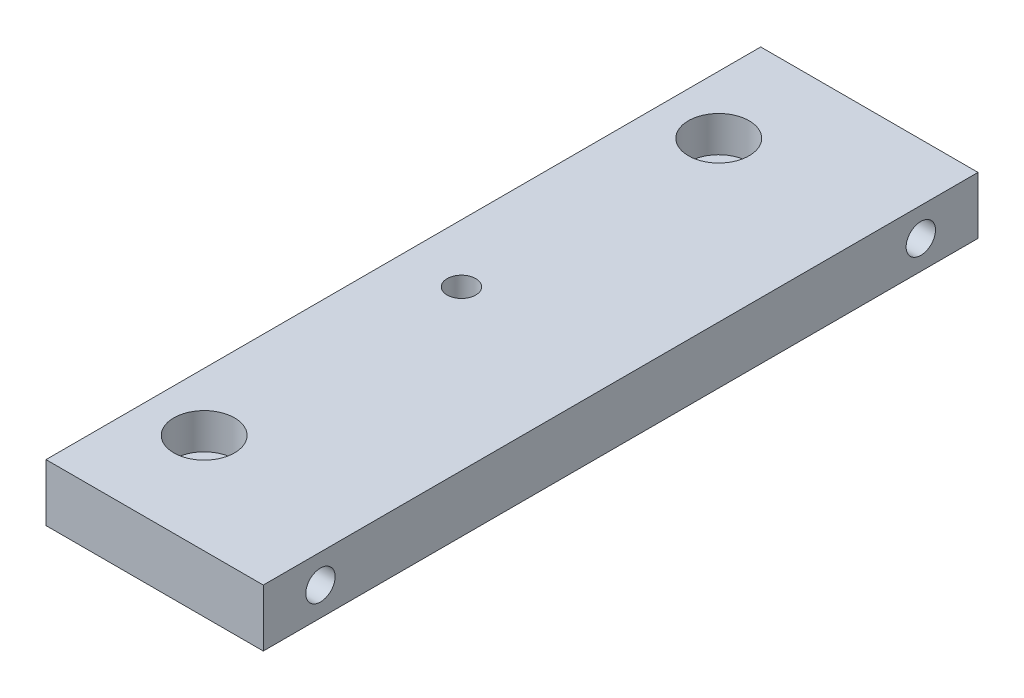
ISO-10303-21;
HEADER;
FILE_DESCRIPTION(('STEP AP214'),'2;1');
FILE_NAME('part.step','',(''),(''),'','','');
FILE_SCHEMA(('AUTOMOTIVE_DESIGN { 1 0 10303 214 1 1 1 1 }'));
ENDSEC;
DATA;
#1=APPLICATION_CONTEXT('core data for automotive mechanical design processes');
#2=APPLICATION_PROTOCOL_DEFINITION('international standard','automotive_design',2000,#1);
#3=PRODUCT_CONTEXT('',#1,'mechanical');
#4=PRODUCT('Part','Part','',(#3));
#5=PRODUCT_RELATED_PRODUCT_CATEGORY('part','',(#4));
#6=PRODUCT_DEFINITION_FORMATION('','',#4);
#7=PRODUCT_DEFINITION_CONTEXT('part definition',#1,'design');
#8=PRODUCT_DEFINITION('design','',#6,#7);
#9=PRODUCT_DEFINITION_SHAPE('','',#8);
#10=(LENGTH_UNIT() NAMED_UNIT(*) SI_UNIT(.MILLI.,.METRE.));
#11=(NAMED_UNIT(*) PLANE_ANGLE_UNIT() SI_UNIT($,.RADIAN.));
#12=(NAMED_UNIT(*) SI_UNIT($,.STERADIAN.) SOLID_ANGLE_UNIT());
#13=UNCERTAINTY_MEASURE_WITH_UNIT(LENGTH_MEASURE(1.E-05),#10,'distance_accuracy_value','');
#14=(GEOMETRIC_REPRESENTATION_CONTEXT(3) GLOBAL_UNCERTAINTY_ASSIGNED_CONTEXT((#13)) GLOBAL_UNIT_ASSIGNED_CONTEXT((#10,
#11,#12)) REPRESENTATION_CONTEXT('',''));
#15=CARTESIAN_POINT('',(0.,0.,0.));
#16=DIRECTION('',(0.,0.,1.));
#17=DIRECTION('',(1.,0.,0.));
#18=AXIS2_PLACEMENT_3D('',#15,#16,#17);
#19=CARTESIAN_POINT('',(24.13,6.35,-79.375));
#20=DIRECTION('',(-1.,0.,0.));
#21=DIRECTION('',(0.,0.,1.));
#22=AXIS2_PLACEMENT_3D('',#19,#20,#21);
#23=PLANE('',#22);
#24=CARTESIAN_POINT('',(24.13,0.,-66.675));
#25=DIRECTION('',(1.,0.,0.));
#26=DIRECTION('',(0.,0.,-1.));
#27=AXIS2_PLACEMENT_3D('',#24,#25,#26);
#28=CIRCLE('',#27,3.2639);
#29=CARTESIAN_POINT('',(24.13,0.,-69.9389));
#30=VERTEX_POINT('',#29);
#31=EDGE_CURVE('E104',#30,#30,#28,.T.);
#32=ORIENTED_EDGE('',*,*,#31,.F.);
#33=EDGE_LOOP('',(#32));
#34=FACE_BOUND('',#33,.T.);
#35=CARTESIAN_POINT('',(24.13,0.,66.675));
#36=DIRECTION('',(1.,0.,0.));
#37=DIRECTION('',(0.,0.,-1.));
#38=AXIS2_PLACEMENT_3D('',#35,#36,#37);
#39=CIRCLE('',#38,3.2639);
#40=CARTESIAN_POINT('',(24.13,0.,63.4111));
#41=VERTEX_POINT('',#40);
#42=EDGE_CURVE('E103',#41,#41,#39,.T.);
#43=ORIENTED_EDGE('',*,*,#42,.F.);
#44=EDGE_LOOP('',(#43));
#45=FACE_BOUND('',#44,.T.);
#46=DIRECTION('',(0.,0.,-1.));
#47=VECTOR('',#46,1.);
#48=CARTESIAN_POINT('',(24.13,-6.35,-79.375));
#49=LINE('',#48,#47);
#50=CARTESIAN_POINT('',(24.13,-6.35,79.375));
#51=VERTEX_POINT('',#50);
#52=CARTESIAN_POINT('',(24.13,-6.35,-79.375));
#53=VERTEX_POINT('',#52);
#54=EDGE_CURVE('E144',#51,#53,#49,.T.);
#55=ORIENTED_EDGE('',*,*,#54,.T.);
#56=DIRECTION('',(0.,-1.,0.));
#57=VECTOR('',#56,1.);
#58=CARTESIAN_POINT('',(24.13,6.35,-79.375));
#59=LINE('',#58,#57);
#60=CARTESIAN_POINT('',(24.13,6.35,-79.375));
#61=VERTEX_POINT('',#60);
#62=EDGE_CURVE('E11',#61,#53,#59,.T.);
#63=ORIENTED_EDGE('',*,*,#62,.F.);
#64=DIRECTION('',(0.,0.,-1.));
#65=VECTOR('',#64,1.);
#66=CARTESIAN_POINT('',(24.13,6.35,-79.375));
#67=LINE('',#66,#65);
#68=CARTESIAN_POINT('',(24.13,6.35,79.375));
#69=VERTEX_POINT('',#68);
#70=EDGE_CURVE('E145',#69,#61,#67,.T.);
#71=ORIENTED_EDGE('',*,*,#70,.F.);
#72=DIRECTION('',(0.,-1.,0.));
#73=VECTOR('',#72,1.);
#74=CARTESIAN_POINT('',(24.13,6.35,79.375));
#75=LINE('',#74,#73);
#76=EDGE_CURVE('E151',#69,#51,#75,.T.);
#77=ORIENTED_EDGE('',*,*,#76,.T.);
#78=EDGE_LOOP('',(#55,#63,#71,#77));
#79=FACE_BOUND('',#78,.T.);
#80=ADVANCED_FACE('F39',(#34,#45,#79),#23,.F.);
#81=CARTESIAN_POINT('',(-24.13,6.35,-79.375));
#82=DIRECTION('',(0.,0.,1.));
#83=DIRECTION('',(1.,0.,0.));
#84=AXIS2_PLACEMENT_3D('',#81,#82,#83);
#85=PLANE('',#84);
#86=DIRECTION('',(-1.,0.,0.));
#87=VECTOR('',#86,1.);
#88=CARTESIAN_POINT('',(-24.13,-6.35,-79.375));
#89=LINE('',#88,#87);
#90=CARTESIAN_POINT('',(-24.13,-6.35,-79.375));
#91=VERTEX_POINT('',#90);
#92=EDGE_CURVE('E154',#53,#91,#89,.T.);
#93=ORIENTED_EDGE('',*,*,#92,.T.);
#94=DIRECTION('',(0.,-1.,0.));
#95=VECTOR('',#94,1.);
#96=CARTESIAN_POINT('',(-24.13,6.35,-79.375));
#97=LINE('',#96,#95);
#98=CARTESIAN_POINT('',(-24.13,6.35,-79.375));
#99=VERTEX_POINT('',#98);
#100=EDGE_CURVE('E47',#99,#91,#97,.T.);
#101=ORIENTED_EDGE('',*,*,#100,.F.);
#102=DIRECTION('',(-1.,0.,0.));
#103=VECTOR('',#102,1.);
#104=CARTESIAN_POINT('',(-24.13,6.35,-79.375));
#105=LINE('',#104,#103);
#106=EDGE_CURVE('E86',#61,#99,#105,.T.);
#107=ORIENTED_EDGE('',*,*,#106,.F.);
#108=ORIENTED_EDGE('',*,*,#62,.T.);
#109=EDGE_LOOP('',(#93,#101,#107,#108));
#110=FACE_BOUND('',#109,.T.);
#111=ADVANCED_FACE('F178',(#110),#85,.F.);
#112=CARTESIAN_POINT('',(-24.13,6.35,-79.375));
#113=DIRECTION('',(1.,0.,0.));
#114=DIRECTION('',(0.,0.,-1.));
#115=AXIS2_PLACEMENT_3D('',#112,#113,#114);
#116=PLANE('',#115);
#117=DIRECTION('',(0.,0.,1.));
#118=VECTOR('',#117,1.);
#119=CARTESIAN_POINT('',(-24.13,-6.35,-79.375));
#120=LINE('',#119,#118);
#121=CARTESIAN_POINT('',(-24.13,-6.35,79.375));
#122=VERTEX_POINT('',#121);
#123=EDGE_CURVE('E73',#91,#122,#120,.T.);
#124=ORIENTED_EDGE('',*,*,#123,.T.);
#125=DIRECTION('',(0.,-1.,0.));
#126=VECTOR('',#125,1.);
#127=CARTESIAN_POINT('',(-24.13,6.35,79.375));
#128=LINE('',#127,#126);
#129=CARTESIAN_POINT('',(-24.13,6.35,79.375));
#130=VERTEX_POINT('',#129);
#131=EDGE_CURVE('E159',#130,#122,#128,.T.);
#132=ORIENTED_EDGE('',*,*,#131,.F.);
#133=DIRECTION('',(0.,0.,1.));
#134=VECTOR('',#133,1.);
#135=CARTESIAN_POINT('',(-24.13,6.35,-79.375));
#136=LINE('',#135,#134);
#137=EDGE_CURVE('E148',#99,#130,#136,.T.);
#138=ORIENTED_EDGE('',*,*,#137,.F.);
#139=ORIENTED_EDGE('',*,*,#100,.T.);
#140=EDGE_LOOP('',(#124,#132,#138,#139));
#141=FACE_BOUND('',#140,.T.);
#142=ADVANCED_FACE('F161',(#141),#116,.F.);
#143=CARTESIAN_POINT('',(-24.13,6.35,79.375));
#144=DIRECTION('',(0.,0.,-1.));
#145=DIRECTION('',(-1.,0.,0.));
#146=AXIS2_PLACEMENT_3D('',#143,#144,#145);
#147=PLANE('',#146);
#148=DIRECTION('',(1.,0.,0.));
#149=VECTOR('',#148,1.);
#150=CARTESIAN_POINT('',(-24.13,-6.35,79.375));
#151=LINE('',#150,#149);
#152=EDGE_CURVE('E79',#122,#51,#151,.T.);
#153=ORIENTED_EDGE('',*,*,#152,.T.);
#154=ORIENTED_EDGE('',*,*,#76,.F.);
#155=DIRECTION('',(1.,0.,0.));
#156=VECTOR('',#155,1.);
#157=CARTESIAN_POINT('',(-24.13,6.35,79.375));
#158=LINE('',#157,#156);
#159=EDGE_CURVE('E55',#130,#69,#158,.T.);
#160=ORIENTED_EDGE('',*,*,#159,.F.);
#161=ORIENTED_EDGE('',*,*,#131,.T.);
#162=EDGE_LOOP('',(#153,#154,#160,#161));
#163=FACE_BOUND('',#162,.T.);
#164=ADVANCED_FACE('F168',(#163),#147,.F.);
#165=CARTESIAN_POINT('',(0.,6.35,0.));
#166=DIRECTION('',(0.,1.,0.));
#167=DIRECTION('',(0.,0.,1.));
#168=AXIS2_PLACEMENT_3D('',#165,#166,#167);
#169=PLANE('',#168);
#170=CARTESIAN_POINT('',(-11.2252074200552,6.35,-2.0122792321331E-11));
#171=DIRECTION('',(0.,-1.,0.));
#172=DIRECTION('',(0.,0.,-1.));
#173=AXIS2_PLACEMENT_3D('',#170,#171,#172);
#174=CIRCLE('',#173,3.175);
#175=CARTESIAN_POINT('',(-11.2252074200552,6.35,-3.17500000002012));
#176=VERTEX_POINT('',#175);
#177=EDGE_CURVE('E117',#176,#176,#174,.T.);
#178=ORIENTED_EDGE('',*,*,#177,.T.);
#179=EDGE_LOOP('',(#178));
#180=FACE_BOUND('',#179,.T.);
#181=CARTESIAN_POINT('',(-11.2252074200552,6.35,57.1499999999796));
#182=DIRECTION('',(0.,1.,0.));
#183=DIRECTION('',(0.,0.,1.));
#184=AXIS2_PLACEMENT_3D('',#181,#182,#183);
#185=CIRCLE('',#184,6.74751);
#186=CARTESIAN_POINT('',(-11.2252074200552,6.35,63.8975099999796));
#187=VERTEX_POINT('',#186);
#188=EDGE_CURVE('E120',#187,#187,#185,.T.);
#189=ORIENTED_EDGE('',*,*,#188,.F.);
#190=EDGE_LOOP('',(#189));
#191=FACE_BOUND('',#190,.T.);
#192=CARTESIAN_POINT('',(-11.2252074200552,6.35,-57.1500000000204));
#193=DIRECTION('',(0.,1.,0.));
#194=DIRECTION('',(0.,0.,1.));
#195=AXIS2_PLACEMENT_3D('',#192,#193,#194);
#196=CIRCLE('',#195,6.74751);
#197=CARTESIAN_POINT('',(-11.2252074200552,6.35,-50.4024900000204));
#198=VERTEX_POINT('',#197);
#199=EDGE_CURVE('E132',#198,#198,#196,.T.);
#200=ORIENTED_EDGE('',*,*,#199,.F.);
#201=EDGE_LOOP('',(#200));
#202=FACE_BOUND('',#201,.T.);
#203=ORIENTED_EDGE('',*,*,#70,.T.);
#204=ORIENTED_EDGE('',*,*,#106,.T.);
#205=ORIENTED_EDGE('',*,*,#137,.T.);
#206=ORIENTED_EDGE('',*,*,#159,.T.);
#207=EDGE_LOOP('',(#203,#204,#205,#206));
#208=FACE_BOUND('',#207,.T.);
#209=ADVANCED_FACE('F170',(#180,#191,#202,#208),#169,.T.);
#210=CARTESIAN_POINT('',(0.,-6.35,0.));
#211=DIRECTION('',(0.,1.,0.));
#212=DIRECTION('',(0.,0.,1.));
#213=AXIS2_PLACEMENT_3D('',#210,#211,#212);
#214=PLANE('',#213);
#215=CARTESIAN_POINT('',(-11.2252074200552,-6.35,-2.0122792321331E-11));
#216=DIRECTION('',(0.,-1.,0.));
#217=DIRECTION('',(0.,0.,-1.));
#218=AXIS2_PLACEMENT_3D('',#215,#216,#217);
#219=CIRCLE('',#218,3.175);
#220=CARTESIAN_POINT('',(-11.2252074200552,-6.35,-3.17500000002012));
#221=VERTEX_POINT('',#220);
#222=EDGE_CURVE('E114',#221,#221,#219,.T.);
#223=ORIENTED_EDGE('',*,*,#222,.F.);
#224=EDGE_LOOP('',(#223));
#225=FACE_BOUND('',#224,.T.);
#226=CARTESIAN_POINT('',(-11.2252074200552,-6.35,57.1499999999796));
#227=DIRECTION('',(0.,1.,0.));
#228=DIRECTION('',(0.,0.,1.));
#229=AXIS2_PLACEMENT_3D('',#226,#227,#228);
#230=CIRCLE('',#229,4.2164);
#231=CARTESIAN_POINT('',(-11.2252074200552,-6.35,61.3663999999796));
#232=VERTEX_POINT('',#231);
#233=EDGE_CURVE('E129',#232,#232,#230,.T.);
#234=ORIENTED_EDGE('',*,*,#233,.T.);
#235=EDGE_LOOP('',(#234));
#236=FACE_BOUND('',#235,.T.);
#237=CARTESIAN_POINT('',(-11.2252074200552,-6.35,-57.1500000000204));
#238=DIRECTION('',(0.,1.,0.));
#239=DIRECTION('',(0.,0.,1.));
#240=AXIS2_PLACEMENT_3D('',#237,#238,#239);
#241=CIRCLE('',#240,4.2164);
#242=CARTESIAN_POINT('',(-11.2252074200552,-6.35,-52.9336000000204));
#243=VERTEX_POINT('',#242);
#244=EDGE_CURVE('E141',#243,#243,#241,.T.);
#245=ORIENTED_EDGE('',*,*,#244,.T.);
#246=EDGE_LOOP('',(#245));
#247=FACE_BOUND('',#246,.T.);
#248=ORIENTED_EDGE('',*,*,#54,.F.);
#249=ORIENTED_EDGE('',*,*,#152,.F.);
#250=ORIENTED_EDGE('',*,*,#123,.F.);
#251=ORIENTED_EDGE('',*,*,#92,.F.);
#252=EDGE_LOOP('',(#248,#249,#250,#251));
#253=FACE_BOUND('',#252,.T.);
#254=ADVANCED_FACE('F164',(#225,#236,#247,#253),#214,.F.);
#255=CARTESIAN_POINT('',(-11.2252074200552,6.35,-57.1500000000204));
#256=DIRECTION('',(0.,1.,0.));
#257=DIRECTION('',(0.,0.,1.));
#258=AXIS2_PLACEMENT_3D('',#255,#256,#257);
#259=CYLINDRICAL_SURFACE('',#258,4.2164);
#260=ORIENTED_EDGE('',*,*,#244,.F.);
#261=EDGE_LOOP('',(#260));
#262=FACE_BOUND('',#261,.T.);
#263=CARTESIAN_POINT('',(-11.2252074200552,-1.5875,-57.1500000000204));
#264=DIRECTION('',(0.,1.,0.));
#265=DIRECTION('',(0.,0.,1.));
#266=AXIS2_PLACEMENT_3D('',#263,#264,#265);
#267=CIRCLE('',#266,4.2164);
#268=CARTESIAN_POINT('',(-11.2252074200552,-1.5875,-52.9336000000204));
#269=VERTEX_POINT('',#268);
#270=EDGE_CURVE('E138',#269,#269,#267,.T.);
#271=ORIENTED_EDGE('',*,*,#270,.T.);
#272=EDGE_LOOP('',(#271));
#273=FACE_BOUND('',#272,.T.);
#274=ADVANCED_FACE('F225',(#262,#273),#259,.F.);
#275=CARTESIAN_POINT('',(-7.00880742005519,-1.5875,-57.1500000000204));
#276=DIRECTION('',(0.,-1.,0.));
#277=DIRECTION('',(0.,0.,-1.));
#278=AXIS2_PLACEMENT_3D('',#275,#276,#277);
#279=PLANE('',#278);
#280=ORIENTED_EDGE('',*,*,#270,.F.);
#281=EDGE_LOOP('',(#280));
#282=FACE_BOUND('',#281,.T.);
#283=CARTESIAN_POINT('',(-11.2252074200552,-1.5875,-57.1500000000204));
#284=DIRECTION('',(0.,1.,0.));
#285=DIRECTION('',(0.,0.,1.));
#286=AXIS2_PLACEMENT_3D('',#283,#284,#285);
#287=CIRCLE('',#286,6.74751);
#288=CARTESIAN_POINT('',(-11.2252074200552,-1.5875,-50.4024900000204));
#289=VERTEX_POINT('',#288);
#290=EDGE_CURVE('E135',#289,#289,#287,.T.);
#291=ORIENTED_EDGE('',*,*,#290,.T.);
#292=EDGE_LOOP('',(#291));
#293=FACE_BOUND('',#292,.T.);
#294=ADVANCED_FACE('F221',(#282,#293),#279,.F.);
#295=CARTESIAN_POINT('',(-11.2252074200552,6.35,-57.1500000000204));
#296=DIRECTION('',(0.,1.,0.));
#297=DIRECTION('',(0.,0.,1.));
#298=AXIS2_PLACEMENT_3D('',#295,#296,#297);
#299=CYLINDRICAL_SURFACE('',#298,6.74751);
#300=ORIENTED_EDGE('',*,*,#290,.F.);
#301=EDGE_LOOP('',(#300));
#302=FACE_BOUND('',#301,.T.);
#303=ORIENTED_EDGE('',*,*,#199,.T.);
#304=EDGE_LOOP('',(#303));
#305=FACE_BOUND('',#304,.T.);
#306=ADVANCED_FACE('F217',(#302,#305),#299,.F.);
#307=CARTESIAN_POINT('',(-11.2252074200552,6.35,57.1499999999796));
#308=DIRECTION('',(0.,1.,0.));
#309=DIRECTION('',(0.,0.,1.));
#310=AXIS2_PLACEMENT_3D('',#307,#308,#309);
#311=CYLINDRICAL_SURFACE('',#310,4.2164);
#312=ORIENTED_EDGE('',*,*,#233,.F.);
#313=EDGE_LOOP('',(#312));
#314=FACE_BOUND('',#313,.T.);
#315=CARTESIAN_POINT('',(-11.2252074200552,-1.5875,57.1499999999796));
#316=DIRECTION('',(0.,1.,0.));
#317=DIRECTION('',(0.,0.,1.));
#318=AXIS2_PLACEMENT_3D('',#315,#316,#317);
#319=CIRCLE('',#318,4.2164);
#320=CARTESIAN_POINT('',(-11.2252074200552,-1.5875,61.3663999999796));
#321=VERTEX_POINT('',#320);
#322=EDGE_CURVE('E126',#321,#321,#319,.T.);
#323=ORIENTED_EDGE('',*,*,#322,.T.);
#324=EDGE_LOOP('',(#323));
#325=FACE_BOUND('',#324,.T.);
#326=ADVANCED_FACE('F213',(#314,#325),#311,.F.);
#327=CARTESIAN_POINT('',(-7.00880742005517,-1.5875,57.1499999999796));
#328=DIRECTION('',(0.,-1.,0.));
#329=DIRECTION('',(0.,0.,-1.));
#330=AXIS2_PLACEMENT_3D('',#327,#328,#329);
#331=PLANE('',#330);
#332=ORIENTED_EDGE('',*,*,#322,.F.);
#333=EDGE_LOOP('',(#332));
#334=FACE_BOUND('',#333,.T.);
#335=CARTESIAN_POINT('',(-11.2252074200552,-1.5875,57.1499999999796));
#336=DIRECTION('',(0.,1.,0.));
#337=DIRECTION('',(0.,0.,1.));
#338=AXIS2_PLACEMENT_3D('',#335,#336,#337);
#339=CIRCLE('',#338,6.74751);
#340=CARTESIAN_POINT('',(-11.2252074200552,-1.5875,63.8975099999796));
#341=VERTEX_POINT('',#340);
#342=EDGE_CURVE('E123',#341,#341,#339,.T.);
#343=ORIENTED_EDGE('',*,*,#342,.T.);
#344=EDGE_LOOP('',(#343));
#345=FACE_BOUND('',#344,.T.);
#346=ADVANCED_FACE('F209',(#334,#345),#331,.F.);
#347=CARTESIAN_POINT('',(-11.2252074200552,6.35,57.1499999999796));
#348=DIRECTION('',(0.,1.,0.));
#349=DIRECTION('',(0.,0.,1.));
#350=AXIS2_PLACEMENT_3D('',#347,#348,#349);
#351=CYLINDRICAL_SURFACE('',#350,6.74751);
#352=ORIENTED_EDGE('',*,*,#342,.F.);
#353=EDGE_LOOP('',(#352));
#354=FACE_BOUND('',#353,.T.);
#355=ORIENTED_EDGE('',*,*,#188,.T.);
#356=EDGE_LOOP('',(#355));
#357=FACE_BOUND('',#356,.T.);
#358=ADVANCED_FACE('F205',(#354,#357),#351,.F.);
#359=CARTESIAN_POINT('',(-11.2252074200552,-6.35,-2.0122792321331E-11));
#360=DIRECTION('',(0.,-1.,0.));
#361=DIRECTION('',(0.,0.,-1.));
#362=AXIS2_PLACEMENT_3D('',#359,#360,#361);
#363=CYLINDRICAL_SURFACE('',#362,3.175);
#364=ORIENTED_EDGE('',*,*,#177,.F.);
#365=EDGE_LOOP('',(#364));
#366=FACE_BOUND('',#365,.T.);
#367=ORIENTED_EDGE('',*,*,#222,.T.);
#368=EDGE_LOOP('',(#367));
#369=FACE_BOUND('',#368,.T.);
#370=ADVANCED_FACE('F197',(#366,#369),#363,.F.);
#371=CARTESIAN_POINT('',(3.81,0.,66.675));
#372=DIRECTION('',(1.,0.,0.));
#373=DIRECTION('',(0.,0.,-1.));
#374=AXIS2_PLACEMENT_3D('',#371,#372,#373);
#375=CONICAL_SURFACE('',#374,3.2639,1.02974425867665);
#376=CARTESIAN_POINT('',(1.84885102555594,0.,66.675));
#377=VERTEX_POINT('',#376);
#378=VERTEX_LOOP('',#377);
#379=FACE_BOUND('',#378,.T.);
#380=CARTESIAN_POINT('',(3.81,0.,66.675));
#381=DIRECTION('',(1.,0.,0.));
#382=DIRECTION('',(0.,0.,-1.));
#383=AXIS2_PLACEMENT_3D('',#380,#381,#382);
#384=CIRCLE('',#383,3.2639);
#385=CARTESIAN_POINT('',(3.81,0.,63.4111));
#386=VERTEX_POINT('',#385);
#387=EDGE_CURVE('E107',#386,#386,#384,.T.);
#388=ORIENTED_EDGE('',*,*,#387,.T.);
#389=EDGE_LOOP('',(#388));
#390=FACE_BOUND('',#389,.T.);
#391=ADVANCED_FACE('F191',(#379,#390),#375,.F.);
#392=CARTESIAN_POINT('',(24.13,0.,66.675));
#393=DIRECTION('',(1.,0.,0.));
#394=DIRECTION('',(0.,0.,-1.));
#395=AXIS2_PLACEMENT_3D('',#392,#393,#394);
#396=CYLINDRICAL_SURFACE('',#395,3.2639);
#397=ORIENTED_EDGE('',*,*,#387,.F.);
#398=EDGE_LOOP('',(#397));
#399=FACE_BOUND('',#398,.T.);
#400=ORIENTED_EDGE('',*,*,#42,.T.);
#401=EDGE_LOOP('',(#400));
#402=FACE_BOUND('',#401,.T.);
#403=ADVANCED_FACE('F97',(#399,#402),#396,.F.);
#404=CARTESIAN_POINT('',(3.81,0.,-66.675));
#405=DIRECTION('',(1.,0.,0.));
#406=DIRECTION('',(0.,0.,-1.));
#407=AXIS2_PLACEMENT_3D('',#404,#405,#406);
#408=CONICAL_SURFACE('',#407,3.2639,1.02974425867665);
#409=CARTESIAN_POINT('',(1.84885102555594,0.,-66.675));
#410=VERTEX_POINT('',#409);
#411=VERTEX_LOOP('',#410);
#412=FACE_BOUND('',#411,.T.);
#413=CARTESIAN_POINT('',(3.81,0.,-66.675));
#414=DIRECTION('',(1.,0.,0.));
#415=DIRECTION('',(0.,0.,-1.));
#416=AXIS2_PLACEMENT_3D('',#413,#414,#415);
#417=CIRCLE('',#416,3.2639);
#418=CARTESIAN_POINT('',(3.81,0.,-69.9389));
#419=VERTEX_POINT('',#418);
#420=EDGE_CURVE('E101',#419,#419,#417,.T.);
#421=ORIENTED_EDGE('',*,*,#420,.T.);
#422=EDGE_LOOP('',(#421));
#423=FACE_BOUND('',#422,.T.);
#424=ADVANCED_FACE('F93',(#412,#423),#408,.F.);
#425=CARTESIAN_POINT('',(24.13,0.,-66.675));
#426=DIRECTION('',(1.,0.,0.));
#427=DIRECTION('',(0.,0.,-1.));
#428=AXIS2_PLACEMENT_3D('',#425,#426,#427);
#429=CYLINDRICAL_SURFACE('',#428,3.2639);
#430=ORIENTED_EDGE('',*,*,#420,.F.);
#431=EDGE_LOOP('',(#430));
#432=FACE_BOUND('',#431,.T.);
#433=ORIENTED_EDGE('',*,*,#31,.T.);
#434=EDGE_LOOP('',(#433));
#435=FACE_BOUND('',#434,.T.);
#436=ADVANCED_FACE('F96',(#432,#435),#429,.F.);
#437=CLOSED_SHELL('',(#80,#111,#142,#164,#209,#254,#274,#294,#306,#326,#346,#358,#370,#391,#403,
#424,#436));
#438=MANIFOLD_SOLID_BREP('B2',#437);
#439=ADVANCED_BREP_SHAPE_REPRESENTATION('',(#18,#438),#14);
#440=SHAPE_DEFINITION_REPRESENTATION(#9,#439);
ENDSEC;
END-ISO-10303-21;
